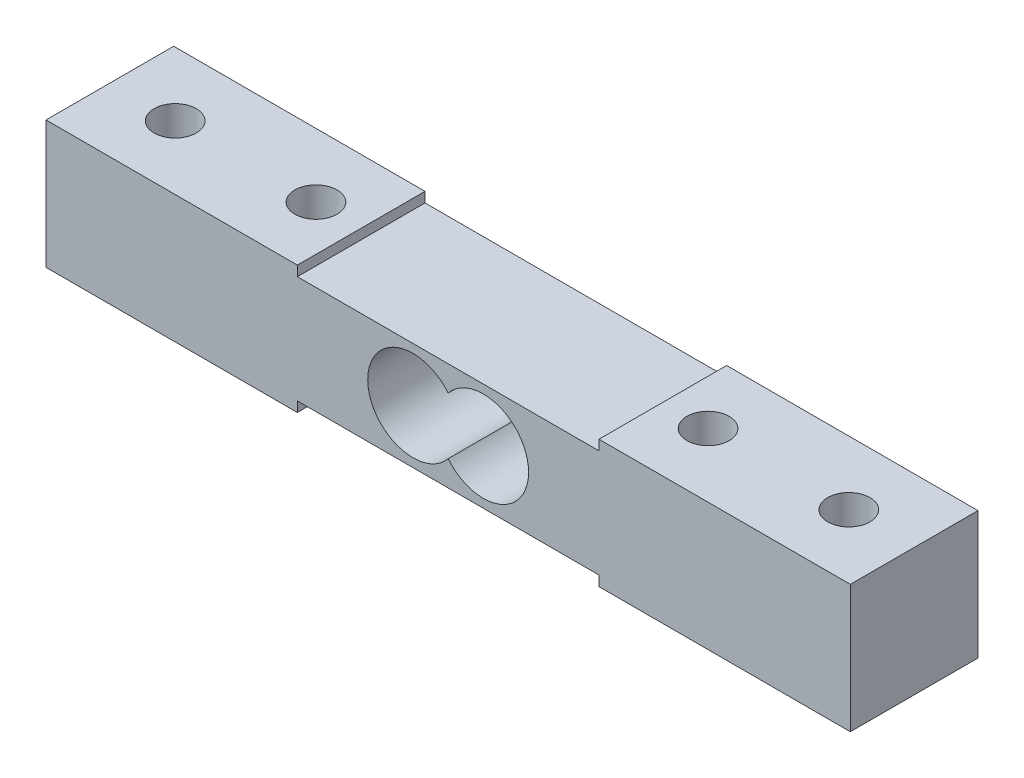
ISO-10303-21;
HEADER;
FILE_DESCRIPTION(('STEP AP214'),'2;1');
FILE_NAME('part.step','',(''),(''),'','','');
FILE_SCHEMA(('AUTOMOTIVE_DESIGN { 1 0 10303 214 1 1 1 1 }'));
ENDSEC;
DATA;
#1=APPLICATION_CONTEXT('core data for automotive mechanical design processes');
#2=APPLICATION_PROTOCOL_DEFINITION('international standard','automotive_design',2000,#1);
#3=PRODUCT_CONTEXT('',#1,'mechanical');
#4=PRODUCT('Part','Part','',(#3));
#5=PRODUCT_RELATED_PRODUCT_CATEGORY('part','',(#4));
#6=PRODUCT_DEFINITION_FORMATION('','',#4);
#7=PRODUCT_DEFINITION_CONTEXT('part definition',#1,'design');
#8=PRODUCT_DEFINITION('design','',#6,#7);
#9=PRODUCT_DEFINITION_SHAPE('','',#8);
#10=(LENGTH_UNIT() NAMED_UNIT(*) SI_UNIT(.MILLI.,.METRE.));
#11=(NAMED_UNIT(*) PLANE_ANGLE_UNIT() SI_UNIT($,.RADIAN.));
#12=(NAMED_UNIT(*) SI_UNIT($,.STERADIAN.) SOLID_ANGLE_UNIT());
#13=UNCERTAINTY_MEASURE_WITH_UNIT(LENGTH_MEASURE(1.E-05),#10,'distance_accuracy_value','');
#14=(GEOMETRIC_REPRESENTATION_CONTEXT(3) GLOBAL_UNCERTAINTY_ASSIGNED_CONTEXT((#13)) GLOBAL_UNIT_ASSIGNED_CONTEXT((#10,
#11,#12)) REPRESENTATION_CONTEXT('',''));
#15=CARTESIAN_POINT('',(0.,0.,0.));
#16=DIRECTION('',(0.,0.,1.));
#17=DIRECTION('',(1.,0.,0.));
#18=AXIS2_PLACEMENT_3D('',#15,#16,#17);
#19=CARTESIAN_POINT('',(-40.,12.7,-6.35));
#20=DIRECTION('',(0.,0.,1.));
#21=DIRECTION('',(1.,0.,0.));
#22=AXIS2_PLACEMENT_3D('',#19,#20,#21);
#23=PLANE('',#22);
#24=DIRECTION('',(0.,-1.,0.));
#25=VECTOR('',#24,1.);
#26=CARTESIAN_POINT('',(15.,1.,-6.35));
#27=LINE('',#26,#25);
#28=CARTESIAN_POINT('',(15.,1.,-6.35));
#29=VERTEX_POINT('',#28);
#30=CARTESIAN_POINT('',(15.,0.,-6.35));
#31=VERTEX_POINT('',#30);
#32=EDGE_CURVE('E175',#29,#31,#27,.T.);
#33=ORIENTED_EDGE('',*,*,#32,.F.);
#34=DIRECTION('',(-1.,0.,0.));
#35=VECTOR('',#34,1.);
#36=CARTESIAN_POINT('',(-15.,1.,-6.35));
#37=LINE('',#36,#35);
#38=CARTESIAN_POINT('',(-15.,1.,-6.35));
#39=VERTEX_POINT('',#38);
#40=EDGE_CURVE('E167',#29,#39,#37,.T.);
#41=ORIENTED_EDGE('',*,*,#40,.T.);
#42=DIRECTION('',(0.,-1.,0.));
#43=VECTOR('',#42,1.);
#44=CARTESIAN_POINT('',(-15.,1.,-6.35));
#45=LINE('',#44,#43);
#46=CARTESIAN_POINT('',(-15.,0.,-6.35));
#47=VERTEX_POINT('',#46);
#48=EDGE_CURVE('E178',#39,#47,#45,.T.);
#49=ORIENTED_EDGE('',*,*,#48,.T.);
#50=DIRECTION('',(-1.,0.,0.));
#51=VECTOR('',#50,1.);
#52=CARTESIAN_POINT('',(-40.,0.,-6.35));
#53=LINE('',#52,#51);
#54=CARTESIAN_POINT('',(-40.,0.,-6.35));
#55=VERTEX_POINT('',#54);
#56=EDGE_CURVE('E252',#47,#55,#53,.T.);
#57=ORIENTED_EDGE('',*,*,#56,.T.);
#58=DIRECTION('',(0.,-1.,0.));
#59=VECTOR('',#58,1.);
#60=CARTESIAN_POINT('',(-40.,12.7,-6.35));
#61=LINE('',#60,#59);
#62=CARTESIAN_POINT('',(-40.,12.7,-6.35));
#63=VERTEX_POINT('',#62);
#64=EDGE_CURVE('E48',#63,#55,#61,.T.);
#65=ORIENTED_EDGE('',*,*,#64,.F.);
#66=DIRECTION('',(-1.,0.,0.));
#67=VECTOR('',#66,1.);
#68=CARTESIAN_POINT('',(-40.,12.7,-6.35));
#69=LINE('',#68,#67);
#70=CARTESIAN_POINT('',(-15.,12.7,-6.35));
#71=VERTEX_POINT('',#70);
#72=EDGE_CURVE('E238',#71,#63,#69,.T.);
#73=ORIENTED_EDGE('',*,*,#72,.F.);
#74=DIRECTION('',(0.,1.,0.));
#75=VECTOR('',#74,1.);
#76=CARTESIAN_POINT('',(-15.,11.7,-6.35));
#77=LINE('',#76,#75);
#78=CARTESIAN_POINT('',(-15.,11.7,-6.35));
#79=VERTEX_POINT('',#78);
#80=EDGE_CURVE('E207',#79,#71,#77,.T.);
#81=ORIENTED_EDGE('',*,*,#80,.F.);
#82=DIRECTION('',(-1.,0.,0.));
#83=VECTOR('',#82,1.);
#84=CARTESIAN_POINT('',(-15.,11.7,-6.35));
#85=LINE('',#84,#83);
#86=CARTESIAN_POINT('',(15.,11.7,-6.35));
#87=VERTEX_POINT('',#86);
#88=EDGE_CURVE('E188',#87,#79,#85,.T.);
#89=ORIENTED_EDGE('',*,*,#88,.F.);
#90=DIRECTION('',(0.,1.,0.));
#91=VECTOR('',#90,1.);
#92=CARTESIAN_POINT('',(15.,11.7,-6.35));
#93=LINE('',#92,#91);
#94=CARTESIAN_POINT('',(15.,12.7,-6.35));
#95=VERTEX_POINT('',#94);
#96=EDGE_CURVE('E198',#87,#95,#93,.T.);
#97=ORIENTED_EDGE('',*,*,#96,.T.);
#98=CARTESIAN_POINT('',(40.,12.7,-6.35));
#99=VERTEX_POINT('',#98);
#100=EDGE_CURVE('E240',#99,#95,#69,.T.);
#101=ORIENTED_EDGE('',*,*,#100,.F.);
#102=DIRECTION('',(0.,-1.,0.));
#103=VECTOR('',#102,1.);
#104=CARTESIAN_POINT('',(40.,12.7,-6.35));
#105=LINE('',#104,#103);
#106=CARTESIAN_POINT('',(40.,0.,-6.35));
#107=VERTEX_POINT('',#106);
#108=EDGE_CURVE('E12',#99,#107,#105,.T.);
#109=ORIENTED_EDGE('',*,*,#108,.T.);
#110=EDGE_CURVE('E253',#107,#31,#53,.T.);
#111=ORIENTED_EDGE('',*,*,#110,.T.);
#112=EDGE_LOOP('',(#33,#41,#49,#57,#65,#73,#81,#89,#97,#101,#109,#111));
#113=FACE_BOUND('',#112,.T.);
#114=CARTESIAN_POINT('',(-3.50000000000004,6.34999999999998,-6.35));
#115=DIRECTION('',(0.,0.,-1.));
#116=DIRECTION('',(-1.,0.,0.));
#117=AXIS2_PLACEMENT_3D('',#114,#115,#116);
#118=CIRCLE('',#117,4.5);
#119=CARTESIAN_POINT('',(0.,3.52157287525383,-6.35));
#120=VERTEX_POINT('',#119);
#121=CARTESIAN_POINT('',(0.,9.17842712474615,-6.35));
#122=VERTEX_POINT('',#121);
#123=EDGE_CURVE('E150',#120,#122,#118,.T.);
#124=ORIENTED_EDGE('',*,*,#123,.F.);
#125=CARTESIAN_POINT('',(3.5,6.35,-6.35));
#126=DIRECTION('',(0.,0.,1.));
#127=DIRECTION('',(1.,0.,0.));
#128=AXIS2_PLACEMENT_3D('',#125,#126,#127);
#129=CIRCLE('',#128,4.5);
#130=EDGE_CURVE('E55',#120,#122,#129,.T.);
#131=ORIENTED_EDGE('',*,*,#130,.T.);
#132=EDGE_LOOP('',(#124,#131));
#133=FACE_BOUND('',#132,.T.);
#134=ADVANCED_FACE('F40',(#113,#133),#23,.F.);
#135=CARTESIAN_POINT('',(-40.,12.7,6.35));
#136=DIRECTION('',(0.,0.,-1.));
#137=DIRECTION('',(-1.,0.,0.));
#138=AXIS2_PLACEMENT_3D('',#135,#136,#137);
#139=PLANE('',#138);
#140=DIRECTION('',(0.,-1.,0.));
#141=VECTOR('',#140,1.);
#142=CARTESIAN_POINT('',(15.,1.,6.35));
#143=LINE('',#142,#141);
#144=CARTESIAN_POINT('',(15.,1.,6.35));
#145=VERTEX_POINT('',#144);
#146=CARTESIAN_POINT('',(15.,0.,6.35));
#147=VERTEX_POINT('',#146);
#148=EDGE_CURVE('E170',#145,#147,#143,.T.);
#149=ORIENTED_EDGE('',*,*,#148,.T.);
#150=DIRECTION('',(1.,0.,0.));
#151=VECTOR('',#150,1.);
#152=CARTESIAN_POINT('',(-40.,0.,6.35));
#153=LINE('',#152,#151);
#154=CARTESIAN_POINT('',(40.,0.,6.35));
#155=VERTEX_POINT('',#154);
#156=EDGE_CURVE('E258',#147,#155,#153,.T.);
#157=ORIENTED_EDGE('',*,*,#156,.T.);
#158=DIRECTION('',(0.,-1.,0.));
#159=VECTOR('',#158,1.);
#160=CARTESIAN_POINT('',(40.,12.7,6.35));
#161=LINE('',#160,#159);
#162=CARTESIAN_POINT('',(40.,12.7,6.35));
#163=VERTEX_POINT('',#162);
#164=EDGE_CURVE('E249',#163,#155,#161,.T.);
#165=ORIENTED_EDGE('',*,*,#164,.F.);
#166=DIRECTION('',(1.,0.,0.));
#167=VECTOR('',#166,1.);
#168=CARTESIAN_POINT('',(-40.,12.7,6.35));
#169=LINE('',#168,#167);
#170=CARTESIAN_POINT('',(15.,12.7,6.35));
#171=VERTEX_POINT('',#170);
#172=EDGE_CURVE('E245',#171,#163,#169,.T.);
#173=ORIENTED_EDGE('',*,*,#172,.F.);
#174=DIRECTION('',(0.,1.,0.));
#175=VECTOR('',#174,1.);
#176=CARTESIAN_POINT('',(15.,11.7,6.35));
#177=LINE('',#176,#175);
#178=CARTESIAN_POINT('',(15.,11.7,6.35));
#179=VERTEX_POINT('',#178);
#180=EDGE_CURVE('E201',#179,#171,#177,.T.);
#181=ORIENTED_EDGE('',*,*,#180,.F.);
#182=DIRECTION('',(1.,0.,0.));
#183=VECTOR('',#182,1.);
#184=CARTESIAN_POINT('',(-15.,11.7,6.35));
#185=LINE('',#184,#183);
#186=CARTESIAN_POINT('',(-15.,11.7,6.35));
#187=VERTEX_POINT('',#186);
#188=EDGE_CURVE('E195',#187,#179,#185,.T.);
#189=ORIENTED_EDGE('',*,*,#188,.F.);
#190=DIRECTION('',(0.,1.,0.));
#191=VECTOR('',#190,1.);
#192=CARTESIAN_POINT('',(-15.,11.7,6.35));
#193=LINE('',#192,#191);
#194=CARTESIAN_POINT('',(-15.,12.7,6.35));
#195=VERTEX_POINT('',#194);
#196=EDGE_CURVE('E204',#187,#195,#193,.T.);
#197=ORIENTED_EDGE('',*,*,#196,.T.);
#198=CARTESIAN_POINT('',(-40.,12.7,6.35));
#199=VERTEX_POINT('',#198);
#200=EDGE_CURVE('E246',#199,#195,#169,.T.);
#201=ORIENTED_EDGE('',*,*,#200,.F.);
#202=DIRECTION('',(0.,-1.,0.));
#203=VECTOR('',#202,1.);
#204=CARTESIAN_POINT('',(-40.,12.7,6.35));
#205=LINE('',#204,#203);
#206=CARTESIAN_POINT('',(-40.,0.,6.35));
#207=VERTEX_POINT('',#206);
#208=EDGE_CURVE('E263',#199,#207,#205,.T.);
#209=ORIENTED_EDGE('',*,*,#208,.T.);
#210=CARTESIAN_POINT('',(-15.,0.,6.35));
#211=VERTEX_POINT('',#210);
#212=EDGE_CURVE('E239',#207,#211,#153,.T.);
#213=ORIENTED_EDGE('',*,*,#212,.T.);
#214=DIRECTION('',(0.,-1.,0.));
#215=VECTOR('',#214,1.);
#216=CARTESIAN_POINT('',(-15.,1.,6.35));
#217=LINE('',#216,#215);
#218=CARTESIAN_POINT('',(-15.,1.,6.35));
#219=VERTEX_POINT('',#218);
#220=EDGE_CURVE('E181',#219,#211,#217,.T.);
#221=ORIENTED_EDGE('',*,*,#220,.F.);
#222=DIRECTION('',(1.,0.,0.));
#223=VECTOR('',#222,1.);
#224=CARTESIAN_POINT('',(-15.,1.,6.35));
#225=LINE('',#224,#223);
#226=EDGE_CURVE('E161',#219,#145,#225,.T.);
#227=ORIENTED_EDGE('',*,*,#226,.T.);
#228=EDGE_LOOP('',(#149,#157,#165,#173,#181,#189,#197,#201,#209,#213,#221,#227));
#229=FACE_BOUND('',#228,.T.);
#230=CARTESIAN_POINT('',(-3.50000000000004,6.34999999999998,6.35));
#231=DIRECTION('',(0.,0.,-1.));
#232=DIRECTION('',(-1.,0.,0.));
#233=AXIS2_PLACEMENT_3D('',#230,#231,#232);
#234=CIRCLE('',#233,4.5);
#235=CARTESIAN_POINT('',(0.,3.52157287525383,6.35));
#236=VERTEX_POINT('',#235);
#237=CARTESIAN_POINT('',(0.,9.17842712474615,6.35));
#238=VERTEX_POINT('',#237);
#239=EDGE_CURVE('E147',#236,#238,#234,.T.);
#240=ORIENTED_EDGE('',*,*,#239,.T.);
#241=CARTESIAN_POINT('',(3.5,6.35,6.35));
#242=DIRECTION('',(0.,0.,1.));
#243=DIRECTION('',(1.,0.,0.));
#244=AXIS2_PLACEMENT_3D('',#241,#242,#243);
#245=CIRCLE('',#244,4.5);
#246=EDGE_CURVE('E60',#236,#238,#245,.T.);
#247=ORIENTED_EDGE('',*,*,#246,.F.);
#248=EDGE_LOOP('',(#240,#247));
#249=FACE_BOUND('',#248,.T.);
#250=ADVANCED_FACE('F152',(#229,#249),#139,.F.);
#251=CARTESIAN_POINT('',(0.,0.,0.));
#252=DIRECTION('',(0.,1.,0.));
#253=DIRECTION('',(0.,0.,1.));
#254=AXIS2_PLACEMENT_3D('',#251,#252,#253);
#255=PLANE('',#254);
#256=CARTESIAN_POINT('',(19.5,0.,0.));
#257=DIRECTION('',(0.,1.,0.));
#258=DIRECTION('',(0.,0.,1.));
#259=AXIS2_PLACEMENT_3D('',#256,#257,#258);
#260=CIRCLE('',#259,2.1);
#261=CARTESIAN_POINT('',(19.5,0.,2.1));
#262=VERTEX_POINT('',#261);
#263=EDGE_CURVE('E219',#262,#262,#260,.T.);
#264=ORIENTED_EDGE('',*,*,#263,.T.);
#265=EDGE_LOOP('',(#264));
#266=FACE_BOUND('',#265,.T.);
#267=CARTESIAN_POINT('',(33.5,0.,0.));
#268=DIRECTION('',(0.,1.,0.));
#269=DIRECTION('',(0.,0.,1.));
#270=AXIS2_PLACEMENT_3D('',#267,#268,#269);
#271=CIRCLE('',#270,2.1);
#272=CARTESIAN_POINT('',(33.5,0.,2.1));
#273=VERTEX_POINT('',#272);
#274=EDGE_CURVE('E213',#273,#273,#271,.T.);
#275=ORIENTED_EDGE('',*,*,#274,.T.);
#276=EDGE_LOOP('',(#275));
#277=FACE_BOUND('',#276,.T.);
#278=DIRECTION('',(0.,0.,-1.));
#279=VECTOR('',#278,1.);
#280=CARTESIAN_POINT('',(15.,0.,-6.35));
#281=LINE('',#280,#279);
#282=EDGE_CURVE('E143',#147,#31,#281,.T.);
#283=ORIENTED_EDGE('',*,*,#282,.T.);
#284=ORIENTED_EDGE('',*,*,#110,.F.);
#285=DIRECTION('',(0.,0.,-1.));
#286=VECTOR('',#285,1.);
#287=CARTESIAN_POINT('',(40.,0.,-6.35));
#288=LINE('',#287,#286);
#289=EDGE_CURVE('E234',#155,#107,#288,.T.);
#290=ORIENTED_EDGE('',*,*,#289,.F.);
#291=ORIENTED_EDGE('',*,*,#156,.F.);
#292=EDGE_LOOP('',(#283,#284,#290,#291));
#293=FACE_BOUND('',#292,.T.);
#294=ADVANCED_FACE('F308',(#266,#277,#293),#255,.F.);
#295=CARTESIAN_POINT('',(-19.5,0.,0.));
#296=DIRECTION('',(0.,1.,0.));
#297=DIRECTION('',(0.,0.,1.));
#298=AXIS2_PLACEMENT_3D('',#295,#296,#297);
#299=CIRCLE('',#298,2.1);
#300=CARTESIAN_POINT('',(-19.5,0.,2.1));
#301=VERTEX_POINT('',#300);
#302=EDGE_CURVE('E231',#301,#301,#299,.T.);
#303=ORIENTED_EDGE('',*,*,#302,.T.);
#304=EDGE_LOOP('',(#303));
#305=FACE_BOUND('',#304,.T.);
#306=CARTESIAN_POINT('',(-33.5,0.,0.));
#307=DIRECTION('',(0.,1.,0.));
#308=DIRECTION('',(0.,0.,1.));
#309=AXIS2_PLACEMENT_3D('',#306,#307,#308);
#310=CIRCLE('',#309,2.1);
#311=CARTESIAN_POINT('',(-33.5,0.,2.1));
#312=VERTEX_POINT('',#311);
#313=EDGE_CURVE('E225',#312,#312,#310,.T.);
#314=ORIENTED_EDGE('',*,*,#313,.T.);
#315=EDGE_LOOP('',(#314));
#316=FACE_BOUND('',#315,.T.);
#317=DIRECTION('',(0.,0.,1.));
#318=VECTOR('',#317,1.);
#319=CARTESIAN_POINT('',(-15.,0.,-6.35));
#320=LINE('',#319,#318);
#321=EDGE_CURVE('E162',#47,#211,#320,.T.);
#322=ORIENTED_EDGE('',*,*,#321,.T.);
#323=ORIENTED_EDGE('',*,*,#212,.F.);
#324=DIRECTION('',(0.,0.,1.));
#325=VECTOR('',#324,1.);
#326=CARTESIAN_POINT('',(-40.,0.,-6.35));
#327=LINE('',#326,#325);
#328=EDGE_CURVE('E256',#55,#207,#327,.T.);
#329=ORIENTED_EDGE('',*,*,#328,.F.);
#330=ORIENTED_EDGE('',*,*,#56,.F.);
#331=EDGE_LOOP('',(#322,#323,#329,#330));
#332=FACE_BOUND('',#331,.T.);
#333=ADVANCED_FACE('F277',(#305,#316,#332),#255,.F.);
#334=CARTESIAN_POINT('',(0.,12.7,0.));
#335=DIRECTION('',(0.,1.,0.));
#336=DIRECTION('',(0.,0.,1.));
#337=AXIS2_PLACEMENT_3D('',#334,#335,#336);
#338=PLANE('',#337);
#339=DIRECTION('',(0.,0.,-1.));
#340=VECTOR('',#339,1.);
#341=CARTESIAN_POINT('',(15.,12.7,-6.35));
#342=LINE('',#341,#340);
#343=EDGE_CURVE('E177',#171,#95,#342,.T.);
#344=ORIENTED_EDGE('',*,*,#343,.F.);
#345=ORIENTED_EDGE('',*,*,#172,.T.);
#346=DIRECTION('',(0.,0.,-1.));
#347=VECTOR('',#346,1.);
#348=CARTESIAN_POINT('',(40.,12.7,-6.35));
#349=LINE('',#348,#347);
#350=EDGE_CURVE('E235',#163,#99,#349,.T.);
#351=ORIENTED_EDGE('',*,*,#350,.T.);
#352=ORIENTED_EDGE('',*,*,#100,.T.);
#353=EDGE_LOOP('',(#344,#345,#351,#352));
#354=FACE_BOUND('',#353,.T.);
#355=CARTESIAN_POINT('',(19.5,12.7,0.));
#356=DIRECTION('',(0.,1.,0.));
#357=DIRECTION('',(0.,0.,1.));
#358=AXIS2_PLACEMENT_3D('',#355,#356,#357);
#359=CIRCLE('',#358,2.09999999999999);
#360=CARTESIAN_POINT('',(19.5,12.7,2.09999999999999));
#361=VERTEX_POINT('',#360);
#362=EDGE_CURVE('E216',#361,#361,#359,.T.);
#363=ORIENTED_EDGE('',*,*,#362,.F.);
#364=EDGE_LOOP('',(#363));
#365=FACE_BOUND('',#364,.T.);
#366=CARTESIAN_POINT('',(33.5,12.7,0.));
#367=DIRECTION('',(0.,1.,0.));
#368=DIRECTION('',(0.,0.,1.));
#369=AXIS2_PLACEMENT_3D('',#366,#367,#368);
#370=CIRCLE('',#369,2.09999999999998);
#371=CARTESIAN_POINT('',(33.5,12.7,2.09999999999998));
#372=VERTEX_POINT('',#371);
#373=EDGE_CURVE('E203',#372,#372,#370,.T.);
#374=ORIENTED_EDGE('',*,*,#373,.F.);
#375=EDGE_LOOP('',(#374));
#376=FACE_BOUND('',#375,.T.);
#377=ADVANCED_FACE('F299',(#354,#365,#376),#338,.T.);
#378=CARTESIAN_POINT('',(40.,12.7,-6.35));
#379=DIRECTION('',(-1.,0.,0.));
#380=DIRECTION('',(0.,0.,1.));
#381=AXIS2_PLACEMENT_3D('',#378,#379,#380);
#382=PLANE('',#381);
#383=ORIENTED_EDGE('',*,*,#289,.T.);
#384=ORIENTED_EDGE('',*,*,#108,.F.);
#385=ORIENTED_EDGE('',*,*,#350,.F.);
#386=ORIENTED_EDGE('',*,*,#164,.T.);
#387=EDGE_LOOP('',(#383,#384,#385,#386));
#388=FACE_BOUND('',#387,.T.);
#389=ADVANCED_FACE('F42',(#388),#382,.F.);
#390=CARTESIAN_POINT('',(-40.,12.7,-6.35));
#391=DIRECTION('',(1.,0.,0.));
#392=DIRECTION('',(0.,0.,-1.));
#393=AXIS2_PLACEMENT_3D('',#390,#391,#392);
#394=PLANE('',#393);
#395=ORIENTED_EDGE('',*,*,#328,.T.);
#396=ORIENTED_EDGE('',*,*,#208,.F.);
#397=DIRECTION('',(0.,0.,1.));
#398=VECTOR('',#397,1.);
#399=CARTESIAN_POINT('',(-40.,12.7,-6.35));
#400=LINE('',#399,#398);
#401=EDGE_CURVE('E243',#63,#199,#400,.T.);
#402=ORIENTED_EDGE('',*,*,#401,.F.);
#403=ORIENTED_EDGE('',*,*,#64,.T.);
#404=EDGE_LOOP('',(#395,#396,#402,#403));
#405=FACE_BOUND('',#404,.T.);
#406=ADVANCED_FACE('F270',(#405),#394,.F.);
#407=DIRECTION('',(0.,0.,1.));
#408=VECTOR('',#407,1.);
#409=CARTESIAN_POINT('',(-15.,12.7,-6.35));
#410=LINE('',#409,#408);
#411=EDGE_CURVE('E189',#71,#195,#410,.T.);
#412=ORIENTED_EDGE('',*,*,#411,.F.);
#413=ORIENTED_EDGE('',*,*,#72,.T.);
#414=ORIENTED_EDGE('',*,*,#401,.T.);
#415=ORIENTED_EDGE('',*,*,#200,.T.);
#416=EDGE_LOOP('',(#412,#413,#414,#415));
#417=FACE_BOUND('',#416,.T.);
#418=CARTESIAN_POINT('',(-33.5,12.7,0.));
#419=DIRECTION('',(0.,1.,0.));
#420=DIRECTION('',(0.,0.,1.));
#421=AXIS2_PLACEMENT_3D('',#418,#419,#420);
#422=CIRCLE('',#421,2.09999999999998);
#423=CARTESIAN_POINT('',(-33.5,12.7,2.09999999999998));
#424=VERTEX_POINT('',#423);
#425=EDGE_CURVE('E222',#424,#424,#422,.T.);
#426=ORIENTED_EDGE('',*,*,#425,.F.);
#427=EDGE_LOOP('',(#426));
#428=FACE_BOUND('',#427,.T.);
#429=CARTESIAN_POINT('',(-19.5,12.7,0.));
#430=DIRECTION('',(0.,1.,0.));
#431=DIRECTION('',(0.,0.,1.));
#432=AXIS2_PLACEMENT_3D('',#429,#430,#431);
#433=CIRCLE('',#432,2.09999999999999);
#434=CARTESIAN_POINT('',(-19.5,12.7,2.09999999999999));
#435=VERTEX_POINT('',#434);
#436=EDGE_CURVE('E228',#435,#435,#433,.T.);
#437=ORIENTED_EDGE('',*,*,#436,.F.);
#438=EDGE_LOOP('',(#437));
#439=FACE_BOUND('',#438,.T.);
#440=ADVANCED_FACE('F284',(#417,#428,#439),#338,.T.);
#441=CARTESIAN_POINT('',(-19.5,12.7,0.));
#442=DIRECTION('',(0.,1.,0.));
#443=DIRECTION('',(0.,0.,1.));
#444=AXIS2_PLACEMENT_3D('',#441,#442,#443);
#445=CYLINDRICAL_SURFACE('',#444,2.09999999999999);
#446=ORIENTED_EDGE('',*,*,#302,.F.);
#447=EDGE_LOOP('',(#446));
#448=FACE_BOUND('',#447,.T.);
#449=ORIENTED_EDGE('',*,*,#436,.T.);
#450=EDGE_LOOP('',(#449));
#451=FACE_BOUND('',#450,.T.);
#452=ADVANCED_FACE('F340',(#448,#451),#445,.F.);
#453=CARTESIAN_POINT('',(-33.5,12.7,0.));
#454=DIRECTION('',(0.,1.,0.));
#455=DIRECTION('',(0.,0.,1.));
#456=AXIS2_PLACEMENT_3D('',#453,#454,#455);
#457=CYLINDRICAL_SURFACE('',#456,2.09999999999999);
#458=ORIENTED_EDGE('',*,*,#313,.F.);
#459=EDGE_LOOP('',(#458));
#460=FACE_BOUND('',#459,.T.);
#461=ORIENTED_EDGE('',*,*,#425,.T.);
#462=EDGE_LOOP('',(#461));
#463=FACE_BOUND('',#462,.T.);
#464=ADVANCED_FACE('F343',(#460,#463),#457,.F.);
#465=CARTESIAN_POINT('',(19.5,12.7,0.));
#466=DIRECTION('',(0.,1.,0.));
#467=DIRECTION('',(0.,0.,1.));
#468=AXIS2_PLACEMENT_3D('',#465,#466,#467);
#469=CYLINDRICAL_SURFACE('',#468,2.09999999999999);
#470=ORIENTED_EDGE('',*,*,#263,.F.);
#471=EDGE_LOOP('',(#470));
#472=FACE_BOUND('',#471,.T.);
#473=ORIENTED_EDGE('',*,*,#362,.T.);
#474=EDGE_LOOP('',(#473));
#475=FACE_BOUND('',#474,.T.);
#476=ADVANCED_FACE('F347',(#472,#475),#469,.F.);
#477=CARTESIAN_POINT('',(33.5,12.7,0.));
#478=DIRECTION('',(0.,1.,0.));
#479=DIRECTION('',(0.,0.,1.));
#480=AXIS2_PLACEMENT_3D('',#477,#478,#479);
#481=CYLINDRICAL_SURFACE('',#480,2.09999999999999);
#482=ORIENTED_EDGE('',*,*,#274,.F.);
#483=EDGE_LOOP('',(#482));
#484=FACE_BOUND('',#483,.T.);
#485=ORIENTED_EDGE('',*,*,#373,.T.);
#486=EDGE_LOOP('',(#485));
#487=FACE_BOUND('',#486,.T.);
#488=ADVANCED_FACE('F351',(#484,#487),#481,.F.);
#489=CARTESIAN_POINT('',(15.,11.7,-6.35));
#490=DIRECTION('',(1.,0.,0.));
#491=DIRECTION('',(0.,0.,-1.));
#492=AXIS2_PLACEMENT_3D('',#489,#490,#491);
#493=PLANE('',#492);
#494=ORIENTED_EDGE('',*,*,#343,.T.);
#495=ORIENTED_EDGE('',*,*,#96,.F.);
#496=DIRECTION('',(0.,0.,-1.));
#497=VECTOR('',#496,1.);
#498=CARTESIAN_POINT('',(15.,11.7,-6.35));
#499=LINE('',#498,#497);
#500=EDGE_CURVE('E185',#179,#87,#499,.T.);
#501=ORIENTED_EDGE('',*,*,#500,.F.);
#502=ORIENTED_EDGE('',*,*,#180,.T.);
#503=EDGE_LOOP('',(#494,#495,#501,#502));
#504=FACE_BOUND('',#503,.T.);
#505=ADVANCED_FACE('F296',(#504),#493,.F.);
#506=CARTESIAN_POINT('',(-15.,11.7,-6.35));
#507=DIRECTION('',(-1.,0.,0.));
#508=DIRECTION('',(0.,0.,1.));
#509=AXIS2_PLACEMENT_3D('',#506,#507,#508);
#510=PLANE('',#509);
#511=ORIENTED_EDGE('',*,*,#411,.T.);
#512=ORIENTED_EDGE('',*,*,#196,.F.);
#513=DIRECTION('',(0.,0.,1.));
#514=VECTOR('',#513,1.);
#515=CARTESIAN_POINT('',(-15.,11.7,-6.35));
#516=LINE('',#515,#514);
#517=EDGE_CURVE('E192',#79,#187,#516,.T.);
#518=ORIENTED_EDGE('',*,*,#517,.F.);
#519=ORIENTED_EDGE('',*,*,#80,.T.);
#520=EDGE_LOOP('',(#511,#512,#518,#519));
#521=FACE_BOUND('',#520,.T.);
#522=ADVANCED_FACE('F291',(#521),#510,.F.);
#523=CARTESIAN_POINT('',(0.,11.7,0.));
#524=DIRECTION('',(0.,1.,0.));
#525=DIRECTION('',(0.,0.,1.));
#526=AXIS2_PLACEMENT_3D('',#523,#524,#525);
#527=PLANE('',#526);
#528=ORIENTED_EDGE('',*,*,#500,.T.);
#529=ORIENTED_EDGE('',*,*,#88,.T.);
#530=ORIENTED_EDGE('',*,*,#517,.T.);
#531=ORIENTED_EDGE('',*,*,#188,.T.);
#532=EDGE_LOOP('',(#528,#529,#530,#531));
#533=FACE_BOUND('',#532,.T.);
#534=ADVANCED_FACE('F293',(#533),#527,.T.);
#535=CARTESIAN_POINT('',(15.,1.,-6.35));
#536=DIRECTION('',(-1.,0.,0.));
#537=DIRECTION('',(0.,0.,1.));
#538=AXIS2_PLACEMENT_3D('',#535,#536,#537);
#539=PLANE('',#538);
#540=ORIENTED_EDGE('',*,*,#282,.F.);
#541=ORIENTED_EDGE('',*,*,#148,.F.);
#542=DIRECTION('',(0.,0.,-1.));
#543=VECTOR('',#542,1.);
#544=CARTESIAN_POINT('',(15.,1.,-6.35));
#545=LINE('',#544,#543);
#546=EDGE_CURVE('E158',#145,#29,#545,.T.);
#547=ORIENTED_EDGE('',*,*,#546,.T.);
#548=ORIENTED_EDGE('',*,*,#32,.T.);
#549=EDGE_LOOP('',(#540,#541,#547,#548));
#550=FACE_BOUND('',#549,.T.);
#551=ADVANCED_FACE('F311',(#550),#539,.T.);
#552=CARTESIAN_POINT('',(-15.,1.,-6.35));
#553=DIRECTION('',(1.,0.,0.));
#554=DIRECTION('',(0.,0.,-1.));
#555=AXIS2_PLACEMENT_3D('',#552,#553,#554);
#556=PLANE('',#555);
#557=ORIENTED_EDGE('',*,*,#321,.F.);
#558=ORIENTED_EDGE('',*,*,#48,.F.);
#559=DIRECTION('',(0.,0.,1.));
#560=VECTOR('',#559,1.);
#561=CARTESIAN_POINT('',(-15.,1.,-6.35));
#562=LINE('',#561,#560);
#563=EDGE_CURVE('E165',#39,#219,#562,.T.);
#564=ORIENTED_EDGE('',*,*,#563,.T.);
#565=ORIENTED_EDGE('',*,*,#220,.T.);
#566=EDGE_LOOP('',(#557,#558,#564,#565));
#567=FACE_BOUND('',#566,.T.);
#568=ADVANCED_FACE('F318',(#567),#556,.T.);
#569=CARTESIAN_POINT('',(0.,1.,0.));
#570=DIRECTION('',(0.,-1.,0.));
#571=DIRECTION('',(0.,0.,1.));
#572=AXIS2_PLACEMENT_3D('',#569,#570,#571);
#573=PLANE('',#572);
#574=ORIENTED_EDGE('',*,*,#546,.F.);
#575=ORIENTED_EDGE('',*,*,#226,.F.);
#576=ORIENTED_EDGE('',*,*,#563,.F.);
#577=ORIENTED_EDGE('',*,*,#40,.F.);
#578=EDGE_LOOP('',(#574,#575,#576,#577));
#579=FACE_BOUND('',#578,.T.);
#580=ADVANCED_FACE('F316',(#579),#573,.T.);
#581=CARTESIAN_POINT('',(3.5,6.35,-6.35));
#582=DIRECTION('',(0.,0.,1.));
#583=DIRECTION('',(1.,0.,0.));
#584=AXIS2_PLACEMENT_3D('',#581,#582,#583);
#585=CYLINDRICAL_SURFACE('',#584,4.5);
#586=ORIENTED_EDGE('',*,*,#246,.T.);
#587=DIRECTION('',(0.,0.,1.));
#588=VECTOR('',#587,1.);
#589=CARTESIAN_POINT('',(0.,9.17842712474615,0.));
#590=LINE('',#589,#588);
#591=EDGE_CURVE('E144',#122,#238,#590,.T.);
#592=ORIENTED_EDGE('',*,*,#591,.F.);
#593=ORIENTED_EDGE('',*,*,#130,.F.);
#594=DIRECTION('',(0.,0.,1.));
#595=VECTOR('',#594,1.);
#596=CARTESIAN_POINT('',(0.,3.52157287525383,0.));
#597=LINE('',#596,#595);
#598=EDGE_CURVE('E137',#236,#120,#597,.F.);
#599=ORIENTED_EDGE('',*,*,#598,.F.);
#600=EDGE_LOOP('',(#586,#592,#593,#599));
#601=FACE_BOUND('',#600,.T.);
#602=ADVANCED_FACE('F139',(#601),#585,.F.);
#603=CARTESIAN_POINT('',(-3.50000000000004,6.34999999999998,-6.35));
#604=DIRECTION('',(0.,0.,1.));
#605=DIRECTION('',(1.,0.,0.));
#606=AXIS2_PLACEMENT_3D('',#603,#604,#605);
#607=CYLINDRICAL_SURFACE('',#606,4.5);
#608=ORIENTED_EDGE('',*,*,#598,.T.);
#609=ORIENTED_EDGE('',*,*,#123,.T.);
#610=ORIENTED_EDGE('',*,*,#591,.T.);
#611=ORIENTED_EDGE('',*,*,#239,.F.);
#612=EDGE_LOOP('',(#608,#609,#610,#611));
#613=FACE_BOUND('',#612,.T.);
#614=ADVANCED_FACE('F148',(#613),#607,.F.);
#615=CLOSED_SHELL('',(#134,#250,#294,#333,#377,#389,#406,#440,#452,#464,#476,#488,#505,#522,
#534,#551,#568,#580,#602,#614));
#616=MANIFOLD_SOLID_BREP('B2',#615);
#617=ADVANCED_BREP_SHAPE_REPRESENTATION('',(#18,#616),#14);
#618=SHAPE_DEFINITION_REPRESENTATION(#9,#617);
ENDSEC;
END-ISO-10303-21;
